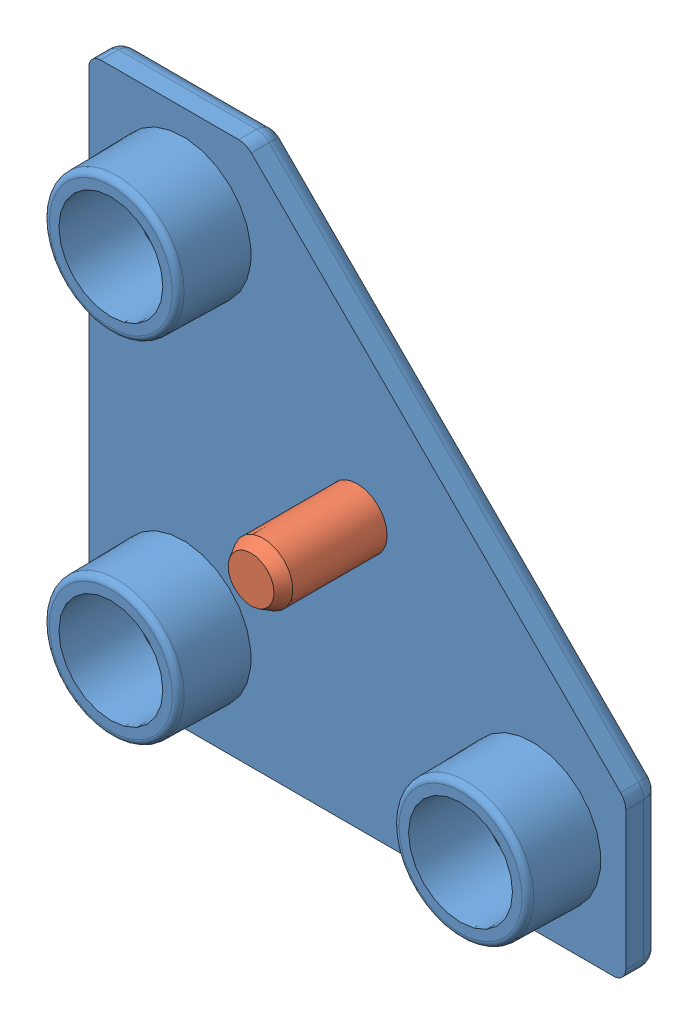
SolidWorks assembly 22.0995_1 END CAP 45-45 DEG GRAY.SLDASM, configuration Default (file format 3800). Lengths in mm.
Overall size (45 45.01 11.9).
2 component instances, 2 part files, 2 mates.
Components (placement in the parent):
- 22.0995_1 END CAP 45-45 DEG GRAY-1: 22.0995_1 END CAP 45-45 DEG GRAY.SLDPRT [Default] at origin size (45 45.01 9.01)
- END CAP DOWEL GRAY-1: END CAP DOWEL GRAY.SLDPRT [Default] at (205.5243 122.6411 13) x (-0.978801 -0.204813 0) z (0 0 1) size (5 5 11.9)
Mates (geometry in assembly coordinates):
- Coincident1: coincident: circle of 22.0995_1 END CAP 45-45 DEG GRAY-1; plane of END CAP DOWEL GRAY-1 through (0 0 0) normal (0 0 -1)
- Concentric1: concentric aligned: cylinder of 22.0995_1 END CAP 45-45 DEG GRAY-1; cylinder of END CAP DOWEL GRAY-1
